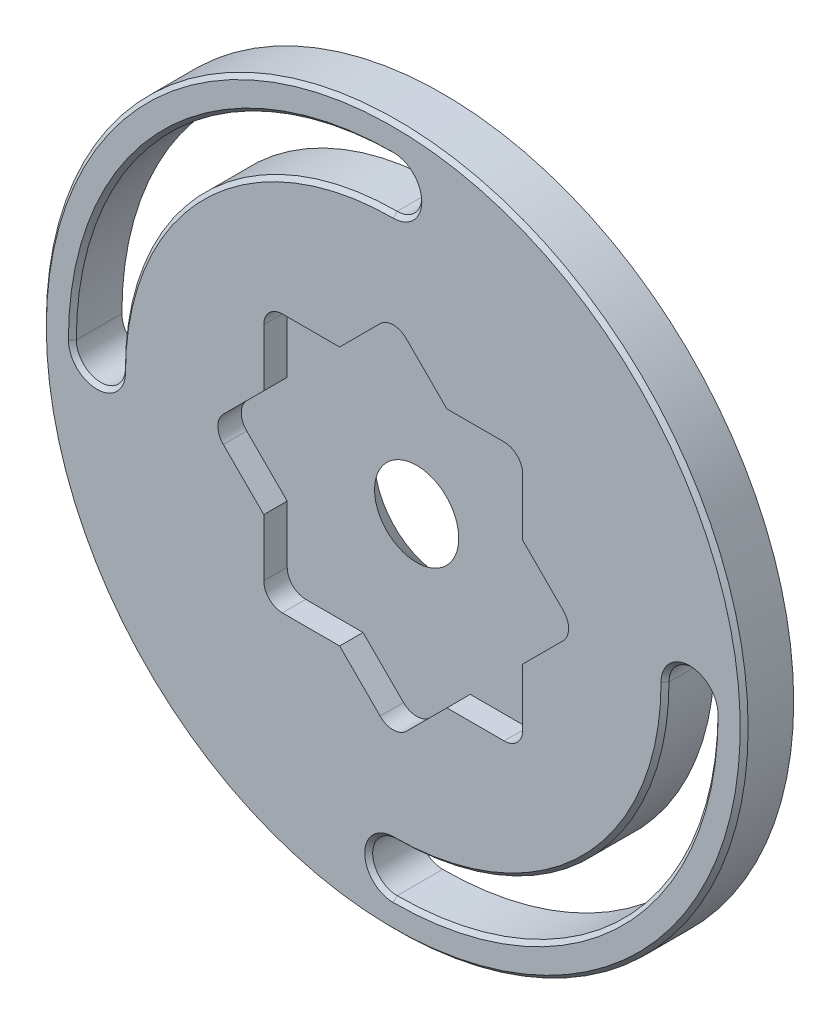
ISO-10303-21;
HEADER;
FILE_DESCRIPTION(('STEP AP214'),'2;1');
FILE_NAME('part.step','',(''),(''),'','','');
FILE_SCHEMA(('AUTOMOTIVE_DESIGN { 1 0 10303 214 1 1 1 1 }'));
ENDSEC;
DATA;
#1=APPLICATION_CONTEXT('core data for automotive mechanical design processes');
#2=APPLICATION_PROTOCOL_DEFINITION('international standard','automotive_design',2000,#1);
#3=PRODUCT_CONTEXT('',#1,'mechanical');
#4=PRODUCT('Part','Part','',(#3));
#5=PRODUCT_RELATED_PRODUCT_CATEGORY('part','',(#4));
#6=PRODUCT_DEFINITION_FORMATION('','',#4);
#7=PRODUCT_DEFINITION_CONTEXT('part definition',#1,'design');
#8=PRODUCT_DEFINITION('design','',#6,#7);
#9=PRODUCT_DEFINITION_SHAPE('','',#8);
#10=(LENGTH_UNIT() NAMED_UNIT(*) SI_UNIT(.MILLI.,.METRE.));
#11=(NAMED_UNIT(*) PLANE_ANGLE_UNIT() SI_UNIT($,.RADIAN.));
#12=(NAMED_UNIT(*) SI_UNIT($,.STERADIAN.) SOLID_ANGLE_UNIT());
#13=UNCERTAINTY_MEASURE_WITH_UNIT(LENGTH_MEASURE(1.E-05),#10,'distance_accuracy_value','');
#14=(GEOMETRIC_REPRESENTATION_CONTEXT(3) GLOBAL_UNCERTAINTY_ASSIGNED_CONTEXT((#13)) GLOBAL_UNIT_ASSIGNED_CONTEXT((#10,
#11,#12)) REPRESENTATION_CONTEXT('',''));
#15=CARTESIAN_POINT('',(0.,0.,0.));
#16=DIRECTION('',(0.,0.,1.));
#17=DIRECTION('',(1.,0.,0.));
#18=AXIS2_PLACEMENT_3D('',#15,#16,#17);
#19=CARTESIAN_POINT('',(0.,-20.1083490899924,6.35));
#20=DIRECTION('',(0.,0.,-1.));
#21=DIRECTION('',(-1.,0.,0.));
#22=AXIS2_PLACEMENT_3D('',#19,#20,#21);
#23=CYLINDRICAL_SURFACE('',#22,2.38125);
#24=DIRECTION('',(0.,0.,1.));
#25=VECTOR('',#24,1.);
#26=CARTESIAN_POINT('',(-1.68379802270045,-21.7921471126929,6.35));
#27=LINE('',#26,#25);
#28=CARTESIAN_POINT('',(-1.68379802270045,-21.7921471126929,3.35));
#29=VERTEX_POINT('',#28);
#30=CARTESIAN_POINT('',(-1.68379802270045,-21.7921471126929,6.35));
#31=VERTEX_POINT('',#30);
#32=EDGE_CURVE('E226',#29,#31,#27,.T.);
#33=ORIENTED_EDGE('',*,*,#32,.T.);
#34=CARTESIAN_POINT('',(0.,-20.1083490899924,6.35));
#35=DIRECTION('',(0.,0.,-1.));
#36=DIRECTION('',(-1.,0.,0.));
#37=AXIS2_PLACEMENT_3D('',#34,#35,#36);
#38=CIRCLE('',#37,2.38125);
#39=CARTESIAN_POINT('',(1.68379802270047,-21.7921471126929,6.35));
#40=VERTEX_POINT('',#39);
#41=EDGE_CURVE('E220',#31,#40,#38,.F.);
#42=ORIENTED_EDGE('',*,*,#41,.T.);
#43=DIRECTION('',(0.,0.,1.));
#44=VECTOR('',#43,1.);
#45=CARTESIAN_POINT('',(1.68379802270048,-21.7921471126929,6.35));
#46=LINE('',#45,#44);
#47=CARTESIAN_POINT('',(1.68379802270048,-21.7921471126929,3.35));
#48=VERTEX_POINT('',#47);
#49=EDGE_CURVE('E211',#40,#48,#46,.F.);
#50=ORIENTED_EDGE('',*,*,#49,.T.);
#51=CARTESIAN_POINT('',(0.,-20.1083490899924,3.35));
#52=DIRECTION('',(0.,0.,-1.));
#53=DIRECTION('',(-1.,0.,0.));
#54=AXIS2_PLACEMENT_3D('',#51,#52,#53);
#55=CIRCLE('',#54,2.38125);
#56=EDGE_CURVE('E377',#29,#48,#55,.F.);
#57=ORIENTED_EDGE('',*,*,#56,.F.);
#58=EDGE_LOOP('',(#33,#42,#50,#57));
#59=FACE_BOUND('',#58,.T.);
#60=ADVANCED_FACE('F15',(#59),#23,.F.);
#61=CARTESIAN_POINT('',(0.,-23.4759451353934,6.35));
#62=DIRECTION('',(0.707106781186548,-0.707106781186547,0.));
#63=DIRECTION('',(0.707106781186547,0.707106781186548,0.));
#64=AXIS2_PLACEMENT_3D('',#61,#62,#63);
#65=PLANE('',#64);
#66=DIRECTION('',(0.707106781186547,0.707106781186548,0.));
#67=VECTOR('',#66,1.);
#68=CARTESIAN_POINT('',(1.68379802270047,-21.7921471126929,6.35));
#69=LINE('',#68,#67);
#70=CARTESIAN_POINT('',(6.87594513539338,-16.6,6.35));
#71=VERTEX_POINT('',#70);
#72=EDGE_CURVE('E215',#40,#71,#69,.T.);
#73=ORIENTED_EDGE('',*,*,#72,.T.);
#74=DIRECTION('',(0.,0.,-1.));
#75=VECTOR('',#74,1.);
#76=CARTESIAN_POINT('',(6.87594513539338,-16.6,6.35));
#77=LINE('',#76,#75);
#78=CARTESIAN_POINT('',(6.87594513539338,-16.6,3.35));
#79=VERTEX_POINT('',#78);
#80=EDGE_CURVE('E202',#71,#79,#77,.T.);
#81=ORIENTED_EDGE('',*,*,#80,.T.);
#82=DIRECTION('',(0.707106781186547,0.707106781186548,0.));
#83=VECTOR('',#82,1.);
#84=CARTESIAN_POINT('',(1.68379802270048,-21.7921471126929,3.35));
#85=LINE('',#84,#83);
#86=EDGE_CURVE('E380',#48,#79,#85,.T.);
#87=ORIENTED_EDGE('',*,*,#86,.F.);
#88=ORIENTED_EDGE('',*,*,#49,.F.);
#89=EDGE_LOOP('',(#73,#81,#87,#88));
#90=FACE_BOUND('',#89,.T.);
#91=ADVANCED_FACE('F216',(#90),#65,.F.);
#92=CARTESIAN_POINT('',(-16.6,-16.6,6.35));
#93=DIRECTION('',(0.,-1.,0.));
#94=DIRECTION('',(0.,0.,-1.));
#95=AXIS2_PLACEMENT_3D('',#92,#93,#94);
#96=PLANE('',#95);
#97=DIRECTION('',(-1.,0.,0.));
#98=VECTOR('',#97,1.);
#99=CARTESIAN_POINT('',(0.,-16.6,6.35));
#100=LINE('',#99,#98);
#101=CARTESIAN_POINT('',(14.21875,-16.6,6.35));
#102=VERTEX_POINT('',#101);
#103=EDGE_CURVE('E197',#71,#102,#100,.F.);
#104=ORIENTED_EDGE('',*,*,#103,.T.);
#105=DIRECTION('',(0.,0.,-1.));
#106=VECTOR('',#105,1.);
#107=CARTESIAN_POINT('',(14.21875,-16.6,6.35));
#108=LINE('',#107,#106);
#109=CARTESIAN_POINT('',(14.21875,-16.6,3.35));
#110=VERTEX_POINT('',#109);
#111=EDGE_CURVE('E210',#102,#110,#108,.T.);
#112=ORIENTED_EDGE('',*,*,#111,.T.);
#113=DIRECTION('',(1.,0.,0.));
#114=VECTOR('',#113,1.);
#115=CARTESIAN_POINT('',(0.,-16.6,3.35));
#116=LINE('',#115,#114);
#117=EDGE_CURVE('E206',#79,#110,#116,.T.);
#118=ORIENTED_EDGE('',*,*,#117,.F.);
#119=ORIENTED_EDGE('',*,*,#80,.F.);
#120=EDGE_LOOP('',(#104,#112,#118,#119));
#121=FACE_BOUND('',#120,.T.);
#122=ADVANCED_FACE('F204',(#121),#96,.F.);
#123=CARTESIAN_POINT('',(14.21875,-14.21875,6.35));
#124=DIRECTION('',(0.,0.,-1.));
#125=DIRECTION('',(-1.,0.,0.));
#126=AXIS2_PLACEMENT_3D('',#123,#124,#125);
#127=CYLINDRICAL_SURFACE('',#126,2.38125);
#128=ORIENTED_EDGE('',*,*,#111,.F.);
#129=CARTESIAN_POINT('',(14.21875,-14.21875,6.35));
#130=DIRECTION('',(0.,0.,-1.));
#131=DIRECTION('',(-1.,0.,0.));
#132=AXIS2_PLACEMENT_3D('',#129,#130,#131);
#133=CIRCLE('',#132,2.38125);
#134=CARTESIAN_POINT('',(16.6,-14.21875,6.35));
#135=VERTEX_POINT('',#134);
#136=EDGE_CURVE('E18',#102,#135,#133,.F.);
#137=ORIENTED_EDGE('',*,*,#136,.T.);
#138=DIRECTION('',(0.,0.,-1.));
#139=VECTOR('',#138,1.);
#140=CARTESIAN_POINT('',(16.6,-14.21875,6.35));
#141=LINE('',#140,#139);
#142=CARTESIAN_POINT('',(16.6,-14.21875,3.35));
#143=VERTEX_POINT('',#142);
#144=EDGE_CURVE('E280',#135,#143,#141,.T.);
#145=ORIENTED_EDGE('',*,*,#144,.T.);
#146=CARTESIAN_POINT('',(14.21875,-14.21875,3.35));
#147=DIRECTION('',(0.,0.,-1.));
#148=DIRECTION('',(-1.,0.,0.));
#149=AXIS2_PLACEMENT_3D('',#146,#147,#148);
#150=CIRCLE('',#149,2.38125);
#151=EDGE_CURVE('E373',#110,#143,#150,.F.);
#152=ORIENTED_EDGE('',*,*,#151,.F.);
#153=EDGE_LOOP('',(#128,#137,#145,#152));
#154=FACE_BOUND('',#153,.T.);
#155=ADVANCED_FACE('F1007',(#154),#127,.F.);
#156=CARTESIAN_POINT('',(16.6,-16.6,6.35));
#157=DIRECTION('',(1.,0.,0.));
#158=DIRECTION('',(0.,0.,-1.));
#159=AXIS2_PLACEMENT_3D('',#156,#157,#158);
#160=PLANE('',#159);
#161=DIRECTION('',(0.,1.,0.));
#162=VECTOR('',#161,1.);
#163=CARTESIAN_POINT('',(16.6,0.,3.35));
#164=LINE('',#163,#162);
#165=CARTESIAN_POINT('',(16.6,-6.87594513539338,3.35));
#166=VERTEX_POINT('',#165);
#167=EDGE_CURVE('E376',#143,#166,#164,.T.);
#168=ORIENTED_EDGE('',*,*,#167,.F.);
#169=ORIENTED_EDGE('',*,*,#144,.F.);
#170=DIRECTION('',(0.,1.,0.));
#171=VECTOR('',#170,1.);
#172=CARTESIAN_POINT('',(16.6,0.,6.35));
#173=LINE('',#172,#171);
#174=CARTESIAN_POINT('',(16.6,-6.87594513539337,6.35));
#175=VERTEX_POINT('',#174);
#176=EDGE_CURVE('E228',#135,#175,#173,.T.);
#177=ORIENTED_EDGE('',*,*,#176,.T.);
#178=DIRECTION('',(0.,0.,1.));
#179=VECTOR('',#178,1.);
#180=CARTESIAN_POINT('',(16.6,-6.87594513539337,6.35));
#181=LINE('',#180,#179);
#182=EDGE_CURVE('E277',#175,#166,#181,.F.);
#183=ORIENTED_EDGE('',*,*,#182,.T.);
#184=EDGE_LOOP('',(#168,#169,#177,#183));
#185=FACE_BOUND('',#184,.T.);
#186=ADVANCED_FACE('F578',(#185),#160,.F.);
#187=CARTESIAN_POINT('',(0.,-23.4759451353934,6.35));
#188=DIRECTION('',(0.707106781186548,-0.707106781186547,0.));
#189=DIRECTION('',(0.707106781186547,0.707106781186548,0.));
#190=AXIS2_PLACEMENT_3D('',#187,#188,#189);
#191=PLANE('',#190);
#192=DIRECTION('',(0.707106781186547,0.707106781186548,0.));
#193=VECTOR('',#192,1.);
#194=CARTESIAN_POINT('',(16.6,-6.87594513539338,3.35));
#195=LINE('',#194,#193);
#196=CARTESIAN_POINT('',(21.7921471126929,-1.68379802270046,3.35));
#197=VERTEX_POINT('',#196);
#198=EDGE_CURVE('E372',#166,#197,#195,.T.);
#199=ORIENTED_EDGE('',*,*,#198,.F.);
#200=ORIENTED_EDGE('',*,*,#182,.F.);
#201=DIRECTION('',(0.707106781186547,0.707106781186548,0.));
#202=VECTOR('',#201,1.);
#203=CARTESIAN_POINT('',(16.6,-6.87594513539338,6.35));
#204=LINE('',#203,#202);
#205=CARTESIAN_POINT('',(21.7921471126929,-1.68379802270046,6.35));
#206=VERTEX_POINT('',#205);
#207=EDGE_CURVE('E407',#175,#206,#204,.T.);
#208=ORIENTED_EDGE('',*,*,#207,.T.);
#209=DIRECTION('',(0.,0.,-1.));
#210=VECTOR('',#209,1.);
#211=CARTESIAN_POINT('',(21.7921471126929,-1.68379802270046,6.35));
#212=LINE('',#211,#210);
#213=EDGE_CURVE('E275',#206,#197,#212,.T.);
#214=ORIENTED_EDGE('',*,*,#213,.T.);
#215=EDGE_LOOP('',(#199,#200,#208,#214));
#216=FACE_BOUND('',#215,.T.);
#217=ADVANCED_FACE('F580',(#216),#191,.F.);
#218=CARTESIAN_POINT('',(20.1083490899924,0.,6.35));
#219=DIRECTION('',(0.,0.,-1.));
#220=DIRECTION('',(-1.,0.,0.));
#221=AXIS2_PLACEMENT_3D('',#218,#219,#220);
#222=CYLINDRICAL_SURFACE('',#221,2.38125);
#223=ORIENTED_EDGE('',*,*,#213,.F.);
#224=CARTESIAN_POINT('',(20.1083490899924,0.,6.35));
#225=DIRECTION('',(0.,0.,-1.));
#226=DIRECTION('',(-1.,0.,0.));
#227=AXIS2_PLACEMENT_3D('',#224,#225,#226);
#228=CIRCLE('',#227,2.38125);
#229=CARTESIAN_POINT('',(21.7921471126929,1.68379802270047,6.35));
#230=VERTEX_POINT('',#229);
#231=EDGE_CURVE('E405',#206,#230,#228,.F.);
#232=ORIENTED_EDGE('',*,*,#231,.T.);
#233=DIRECTION('',(0.,0.,1.));
#234=VECTOR('',#233,1.);
#235=CARTESIAN_POINT('',(21.7921471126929,1.68379802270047,6.35));
#236=LINE('',#235,#234);
#237=CARTESIAN_POINT('',(21.7921471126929,1.68379802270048,3.35));
#238=VERTEX_POINT('',#237);
#239=EDGE_CURVE('E273',#230,#238,#236,.F.);
#240=ORIENTED_EDGE('',*,*,#239,.T.);
#241=CARTESIAN_POINT('',(20.1083490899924,0.,3.35));
#242=DIRECTION('',(0.,0.,-1.));
#243=DIRECTION('',(-1.,0.,0.));
#244=AXIS2_PLACEMENT_3D('',#241,#242,#243);
#245=CIRCLE('',#244,2.38125);
#246=EDGE_CURVE('E368',#197,#238,#245,.F.);
#247=ORIENTED_EDGE('',*,*,#246,.F.);
#248=EDGE_LOOP('',(#223,#232,#240,#247));
#249=FACE_BOUND('',#248,.T.);
#250=ADVANCED_FACE('F596',(#249),#222,.F.);
#251=CARTESIAN_POINT('',(23.4759451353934,0.,6.35));
#252=DIRECTION('',(0.707106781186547,0.707106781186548,0.));
#253=DIRECTION('',(-0.707106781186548,0.707106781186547,0.));
#254=AXIS2_PLACEMENT_3D('',#251,#252,#253);
#255=PLANE('',#254);
#256=DIRECTION('',(-0.707106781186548,0.707106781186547,0.));
#257=VECTOR('',#256,1.);
#258=CARTESIAN_POINT('',(21.7921471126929,1.68379802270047,6.35));
#259=LINE('',#258,#257);
#260=CARTESIAN_POINT('',(16.6,6.87594513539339,6.35));
#261=VERTEX_POINT('',#260);
#262=EDGE_CURVE('E406',#230,#261,#259,.T.);
#263=ORIENTED_EDGE('',*,*,#262,.T.);
#264=DIRECTION('',(0.,0.,-1.));
#265=VECTOR('',#264,1.);
#266=CARTESIAN_POINT('',(16.6,6.87594513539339,6.35));
#267=LINE('',#266,#265);
#268=CARTESIAN_POINT('',(16.6,6.87594513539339,3.35));
#269=VERTEX_POINT('',#268);
#270=EDGE_CURVE('E270',#261,#269,#267,.T.);
#271=ORIENTED_EDGE('',*,*,#270,.T.);
#272=DIRECTION('',(-0.707106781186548,0.707106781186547,0.));
#273=VECTOR('',#272,1.);
#274=CARTESIAN_POINT('',(21.7921471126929,1.68379802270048,3.35));
#275=LINE('',#274,#273);
#276=EDGE_CURVE('E371',#238,#269,#275,.T.);
#277=ORIENTED_EDGE('',*,*,#276,.F.);
#278=ORIENTED_EDGE('',*,*,#239,.F.);
#279=EDGE_LOOP('',(#263,#271,#277,#278));
#280=FACE_BOUND('',#279,.T.);
#281=ADVANCED_FACE('F586',(#280),#255,.F.);
#282=CARTESIAN_POINT('',(16.6,-16.6,6.35));
#283=DIRECTION('',(1.,0.,0.));
#284=DIRECTION('',(0.,0.,-1.));
#285=AXIS2_PLACEMENT_3D('',#282,#283,#284);
#286=PLANE('',#285);
#287=DIRECTION('',(0.,1.,0.));
#288=VECTOR('',#287,1.);
#289=CARTESIAN_POINT('',(16.6,0.,6.35));
#290=LINE('',#289,#288);
#291=CARTESIAN_POINT('',(16.6,14.21875,6.35));
#292=VERTEX_POINT('',#291);
#293=EDGE_CURVE('E404',#261,#292,#290,.T.);
#294=ORIENTED_EDGE('',*,*,#293,.T.);
#295=DIRECTION('',(0.,0.,-1.));
#296=VECTOR('',#295,1.);
#297=CARTESIAN_POINT('',(16.6,14.21875,6.35));
#298=LINE('',#297,#296);
#299=CARTESIAN_POINT('',(16.6,14.21875,3.35));
#300=VERTEX_POINT('',#299);
#301=EDGE_CURVE('E267',#292,#300,#298,.T.);
#302=ORIENTED_EDGE('',*,*,#301,.T.);
#303=DIRECTION('',(0.,1.,0.));
#304=VECTOR('',#303,1.);
#305=CARTESIAN_POINT('',(16.6,0.,3.35));
#306=LINE('',#305,#304);
#307=EDGE_CURVE('E367',#269,#300,#306,.T.);
#308=ORIENTED_EDGE('',*,*,#307,.F.);
#309=ORIENTED_EDGE('',*,*,#270,.F.);
#310=EDGE_LOOP('',(#294,#302,#308,#309));
#311=FACE_BOUND('',#310,.T.);
#312=ADVANCED_FACE('F590',(#311),#286,.F.);
#313=CARTESIAN_POINT('',(14.21875,14.21875,6.35));
#314=DIRECTION('',(0.,0.,-1.));
#315=DIRECTION('',(-1.,0.,0.));
#316=AXIS2_PLACEMENT_3D('',#313,#314,#315);
#317=CYLINDRICAL_SURFACE('',#316,2.38125);
#318=ORIENTED_EDGE('',*,*,#301,.F.);
#319=CARTESIAN_POINT('',(14.21875,14.21875,6.35));
#320=DIRECTION('',(0.,0.,-1.));
#321=DIRECTION('',(-1.,0.,0.));
#322=AXIS2_PLACEMENT_3D('',#319,#320,#321);
#323=CIRCLE('',#322,2.38125);
#324=CARTESIAN_POINT('',(14.21875,16.6,6.35));
#325=VERTEX_POINT('',#324);
#326=EDGE_CURVE('E401',#292,#325,#323,.F.);
#327=ORIENTED_EDGE('',*,*,#326,.T.);
#328=DIRECTION('',(0.,0.,1.));
#329=VECTOR('',#328,1.);
#330=CARTESIAN_POINT('',(14.21875,16.6,6.35));
#331=LINE('',#330,#329);
#332=CARTESIAN_POINT('',(14.21875,16.6,3.35));
#333=VERTEX_POINT('',#332);
#334=EDGE_CURVE('E264',#325,#333,#331,.F.);
#335=ORIENTED_EDGE('',*,*,#334,.T.);
#336=CARTESIAN_POINT('',(14.21875,14.21875,3.35));
#337=DIRECTION('',(0.,0.,-1.));
#338=DIRECTION('',(-1.,0.,0.));
#339=AXIS2_PLACEMENT_3D('',#336,#337,#338);
#340=CIRCLE('',#339,2.38125);
#341=EDGE_CURVE('E362',#300,#333,#340,.F.);
#342=ORIENTED_EDGE('',*,*,#341,.F.);
#343=EDGE_LOOP('',(#318,#327,#335,#342));
#344=FACE_BOUND('',#343,.T.);
#345=ADVANCED_FACE('F742',(#344),#317,.F.);
#346=CARTESIAN_POINT('',(16.6,16.6,6.35));
#347=DIRECTION('',(0.,1.,0.));
#348=DIRECTION('',(0.,0.,1.));
#349=AXIS2_PLACEMENT_3D('',#346,#347,#348);
#350=PLANE('',#349);
#351=DIRECTION('',(1.,0.,0.));
#352=VECTOR('',#351,1.);
#353=CARTESIAN_POINT('',(0.,16.6,3.35));
#354=LINE('',#353,#352);
#355=CARTESIAN_POINT('',(6.87594513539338,16.6,3.35));
#356=VERTEX_POINT('',#355);
#357=EDGE_CURVE('E366',#333,#356,#354,.F.);
#358=ORIENTED_EDGE('',*,*,#357,.F.);
#359=ORIENTED_EDGE('',*,*,#334,.F.);
#360=DIRECTION('',(-1.,0.,0.));
#361=VECTOR('',#360,1.);
#362=CARTESIAN_POINT('',(0.,16.6,6.35));
#363=LINE('',#362,#361);
#364=CARTESIAN_POINT('',(6.87594513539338,16.6,6.35));
#365=VERTEX_POINT('',#364);
#366=EDGE_CURVE('E403',#325,#365,#363,.T.);
#367=ORIENTED_EDGE('',*,*,#366,.T.);
#368=DIRECTION('',(0.,0.,1.));
#369=VECTOR('',#368,1.);
#370=CARTESIAN_POINT('',(6.87594513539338,16.6,6.35));
#371=LINE('',#370,#369);
#372=EDGE_CURVE('E261',#365,#356,#371,.F.);
#373=ORIENTED_EDGE('',*,*,#372,.T.);
#374=EDGE_LOOP('',(#358,#359,#367,#373));
#375=FACE_BOUND('',#374,.T.);
#376=ADVANCED_FACE('F738',(#375),#350,.F.);
#377=CARTESIAN_POINT('',(23.4759451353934,0.,6.35));
#378=DIRECTION('',(0.707106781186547,0.707106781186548,0.));
#379=DIRECTION('',(-0.707106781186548,0.707106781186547,0.));
#380=AXIS2_PLACEMENT_3D('',#377,#378,#379);
#381=PLANE('',#380);
#382=DIRECTION('',(-0.707106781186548,0.707106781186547,0.));
#383=VECTOR('',#382,1.);
#384=CARTESIAN_POINT('',(6.87594513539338,16.6,3.35));
#385=LINE('',#384,#383);
#386=CARTESIAN_POINT('',(1.68379802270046,21.7921471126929,3.35));
#387=VERTEX_POINT('',#386);
#388=EDGE_CURVE('E361',#356,#387,#385,.T.);
#389=ORIENTED_EDGE('',*,*,#388,.F.);
#390=ORIENTED_EDGE('',*,*,#372,.F.);
#391=DIRECTION('',(-0.707106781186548,0.707106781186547,0.));
#392=VECTOR('',#391,1.);
#393=CARTESIAN_POINT('',(6.87594513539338,16.6,6.35));
#394=LINE('',#393,#392);
#395=CARTESIAN_POINT('',(1.68379802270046,21.7921471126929,6.35));
#396=VERTEX_POINT('',#395);
#397=EDGE_CURVE('E400',#365,#396,#394,.T.);
#398=ORIENTED_EDGE('',*,*,#397,.T.);
#399=DIRECTION('',(0.,0.,-1.));
#400=VECTOR('',#399,1.);
#401=CARTESIAN_POINT('',(1.68379802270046,21.7921471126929,6.35));
#402=LINE('',#401,#400);
#403=EDGE_CURVE('E259',#396,#387,#402,.T.);
#404=ORIENTED_EDGE('',*,*,#403,.T.);
#405=EDGE_LOOP('',(#389,#390,#398,#404));
#406=FACE_BOUND('',#405,.T.);
#407=ADVANCED_FACE('F734',(#406),#381,.F.);
#408=CARTESIAN_POINT('',(0.,20.1083490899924,6.35));
#409=DIRECTION('',(0.,0.,-1.));
#410=DIRECTION('',(-1.,0.,0.));
#411=AXIS2_PLACEMENT_3D('',#408,#409,#410);
#412=CYLINDRICAL_SURFACE('',#411,2.38125);
#413=ORIENTED_EDGE('',*,*,#403,.F.);
#414=CARTESIAN_POINT('',(0.,20.1083490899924,6.35));
#415=DIRECTION('',(0.,0.,-1.));
#416=DIRECTION('',(-1.,0.,0.));
#417=AXIS2_PLACEMENT_3D('',#414,#415,#416);
#418=CIRCLE('',#417,2.38125);
#419=CARTESIAN_POINT('',(-1.68379802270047,21.7921471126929,6.35));
#420=VERTEX_POINT('',#419);
#421=EDGE_CURVE('E397',#396,#420,#418,.F.);
#422=ORIENTED_EDGE('',*,*,#421,.T.);
#423=DIRECTION('',(0.,0.,1.));
#424=VECTOR('',#423,1.);
#425=CARTESIAN_POINT('',(-1.68379802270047,21.7921471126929,6.35));
#426=LINE('',#425,#424);
#427=CARTESIAN_POINT('',(-1.68379802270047,21.7921471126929,3.35));
#428=VERTEX_POINT('',#427);
#429=EDGE_CURVE('E257',#420,#428,#426,.F.);
#430=ORIENTED_EDGE('',*,*,#429,.T.);
#431=CARTESIAN_POINT('',(0.,20.1083490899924,3.35));
#432=DIRECTION('',(0.,0.,-1.));
#433=DIRECTION('',(-1.,0.,0.));
#434=AXIS2_PLACEMENT_3D('',#431,#432,#433);
#435=CIRCLE('',#434,2.38125);
#436=EDGE_CURVE('E357',#387,#428,#435,.F.);
#437=ORIENTED_EDGE('',*,*,#436,.F.);
#438=EDGE_LOOP('',(#413,#422,#430,#437));
#439=FACE_BOUND('',#438,.T.);
#440=ADVANCED_FACE('F730',(#439),#412,.F.);
#441=CARTESIAN_POINT('',(0.,23.4759451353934,6.35));
#442=DIRECTION('',(-0.707106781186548,0.707106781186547,0.));
#443=DIRECTION('',(-0.707106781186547,-0.707106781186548,0.));
#444=AXIS2_PLACEMENT_3D('',#441,#442,#443);
#445=PLANE('',#444);
#446=DIRECTION('',(-0.707106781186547,-0.707106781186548,0.));
#447=VECTOR('',#446,1.);
#448=CARTESIAN_POINT('',(-1.68379802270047,21.7921471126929,6.35));
#449=LINE('',#448,#447);
#450=CARTESIAN_POINT('',(-6.87594513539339,16.6,6.35));
#451=VERTEX_POINT('',#450);
#452=EDGE_CURVE('E399',#420,#451,#449,.T.);
#453=ORIENTED_EDGE('',*,*,#452,.T.);
#454=DIRECTION('',(0.,0.,1.));
#455=VECTOR('',#454,1.);
#456=CARTESIAN_POINT('',(-6.87594513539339,16.6,6.35));
#457=LINE('',#456,#455);
#458=CARTESIAN_POINT('',(-6.87594513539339,16.6,3.35));
#459=VERTEX_POINT('',#458);
#460=EDGE_CURVE('E254',#451,#459,#457,.F.);
#461=ORIENTED_EDGE('',*,*,#460,.T.);
#462=DIRECTION('',(-0.707106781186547,-0.707106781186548,0.));
#463=VECTOR('',#462,1.);
#464=CARTESIAN_POINT('',(-1.68379802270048,21.7921471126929,3.35));
#465=LINE('',#464,#463);
#466=EDGE_CURVE('E360',#428,#459,#465,.T.);
#467=ORIENTED_EDGE('',*,*,#466,.F.);
#468=ORIENTED_EDGE('',*,*,#429,.F.);
#469=EDGE_LOOP('',(#453,#461,#467,#468));
#470=FACE_BOUND('',#469,.T.);
#471=ADVANCED_FACE('F726',(#470),#445,.F.);
#472=CARTESIAN_POINT('',(16.6,16.6,6.35));
#473=DIRECTION('',(0.,1.,0.));
#474=DIRECTION('',(0.,0.,1.));
#475=AXIS2_PLACEMENT_3D('',#472,#473,#474);
#476=PLANE('',#475);
#477=DIRECTION('',(-1.,0.,0.));
#478=VECTOR('',#477,1.);
#479=CARTESIAN_POINT('',(0.,16.6,6.35));
#480=LINE('',#479,#478);
#481=CARTESIAN_POINT('',(-14.21875,16.6,6.35));
#482=VERTEX_POINT('',#481);
#483=EDGE_CURVE('E396',#451,#482,#480,.T.);
#484=ORIENTED_EDGE('',*,*,#483,.T.);
#485=DIRECTION('',(0.,0.,-1.));
#486=VECTOR('',#485,1.);
#487=CARTESIAN_POINT('',(-14.21875,16.6,6.35));
#488=LINE('',#487,#486);
#489=CARTESIAN_POINT('',(-14.21875,16.6,3.35));
#490=VERTEX_POINT('',#489);
#491=EDGE_CURVE('E252',#482,#490,#488,.T.);
#492=ORIENTED_EDGE('',*,*,#491,.T.);
#493=DIRECTION('',(1.,0.,0.));
#494=VECTOR('',#493,1.);
#495=CARTESIAN_POINT('',(0.,16.6,3.35));
#496=LINE('',#495,#494);
#497=EDGE_CURVE('E356',#459,#490,#496,.F.);
#498=ORIENTED_EDGE('',*,*,#497,.F.);
#499=ORIENTED_EDGE('',*,*,#460,.F.);
#500=EDGE_LOOP('',(#484,#492,#498,#499));
#501=FACE_BOUND('',#500,.T.);
#502=ADVANCED_FACE('F722',(#501),#476,.F.);
#503=CARTESIAN_POINT('',(-14.21875,14.21875,6.35));
#504=DIRECTION('',(0.,0.,-1.));
#505=DIRECTION('',(-1.,0.,0.));
#506=AXIS2_PLACEMENT_3D('',#503,#504,#505);
#507=CYLINDRICAL_SURFACE('',#506,2.38125);
#508=ORIENTED_EDGE('',*,*,#491,.F.);
#509=CARTESIAN_POINT('',(-14.21875,14.21875,6.35));
#510=DIRECTION('',(0.,0.,-1.));
#511=DIRECTION('',(-1.,0.,0.));
#512=AXIS2_PLACEMENT_3D('',#509,#510,#511);
#513=CIRCLE('',#512,2.38125);
#514=CARTESIAN_POINT('',(-16.6,14.21875,6.35));
#515=VERTEX_POINT('',#514);
#516=EDGE_CURVE('E393',#482,#515,#513,.F.);
#517=ORIENTED_EDGE('',*,*,#516,.T.);
#518=DIRECTION('',(0.,0.,1.));
#519=VECTOR('',#518,1.);
#520=CARTESIAN_POINT('',(-16.6,14.21875,6.35));
#521=LINE('',#520,#519);
#522=CARTESIAN_POINT('',(-16.6,14.21875,3.35));
#523=VERTEX_POINT('',#522);
#524=EDGE_CURVE('E250',#515,#523,#521,.F.);
#525=ORIENTED_EDGE('',*,*,#524,.T.);
#526=CARTESIAN_POINT('',(-14.21875,14.21875,3.35));
#527=DIRECTION('',(0.,0.,-1.));
#528=DIRECTION('',(-1.,0.,0.));
#529=AXIS2_PLACEMENT_3D('',#526,#527,#528);
#530=CIRCLE('',#529,2.38125);
#531=EDGE_CURVE('E352',#490,#523,#530,.F.);
#532=ORIENTED_EDGE('',*,*,#531,.F.);
#533=EDGE_LOOP('',(#508,#517,#525,#532));
#534=FACE_BOUND('',#533,.T.);
#535=ADVANCED_FACE('F718',(#534),#507,.F.);
#536=CARTESIAN_POINT('',(-16.6,16.6,6.35));
#537=DIRECTION('',(-1.,0.,0.));
#538=DIRECTION('',(0.,0.,1.));
#539=AXIS2_PLACEMENT_3D('',#536,#537,#538);
#540=PLANE('',#539);
#541=DIRECTION('',(0.,1.,0.));
#542=VECTOR('',#541,1.);
#543=CARTESIAN_POINT('',(-16.6,0.,3.35));
#544=LINE('',#543,#542);
#545=CARTESIAN_POINT('',(-16.6,6.87594513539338,3.35));
#546=VERTEX_POINT('',#545);
#547=EDGE_CURVE('E355',#523,#546,#544,.F.);
#548=ORIENTED_EDGE('',*,*,#547,.F.);
#549=ORIENTED_EDGE('',*,*,#524,.F.);
#550=DIRECTION('',(0.,1.,0.));
#551=VECTOR('',#550,1.);
#552=CARTESIAN_POINT('',(-16.6,0.,6.35));
#553=LINE('',#552,#551);
#554=CARTESIAN_POINT('',(-16.6,6.87594513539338,6.35));
#555=VERTEX_POINT('',#554);
#556=EDGE_CURVE('E395',#515,#555,#553,.F.);
#557=ORIENTED_EDGE('',*,*,#556,.T.);
#558=DIRECTION('',(0.,0.,1.));
#559=VECTOR('',#558,1.);
#560=CARTESIAN_POINT('',(-16.6,6.87594513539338,6.35));
#561=LINE('',#560,#559);
#562=EDGE_CURVE('E247',#555,#546,#561,.F.);
#563=ORIENTED_EDGE('',*,*,#562,.T.);
#564=EDGE_LOOP('',(#548,#549,#557,#563));
#565=FACE_BOUND('',#564,.T.);
#566=ADVANCED_FACE('F714',(#565),#540,.F.);
#567=CARTESIAN_POINT('',(0.,23.4759451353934,6.35));
#568=DIRECTION('',(-0.707106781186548,0.707106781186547,0.));
#569=DIRECTION('',(-0.707106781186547,-0.707106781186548,0.));
#570=AXIS2_PLACEMENT_3D('',#567,#568,#569);
#571=PLANE('',#570);
#572=DIRECTION('',(-0.707106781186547,-0.707106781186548,0.));
#573=VECTOR('',#572,1.);
#574=CARTESIAN_POINT('',(-16.6,6.87594513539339,3.35));
#575=LINE('',#574,#573);
#576=CARTESIAN_POINT('',(-21.7921471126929,1.68379802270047,3.35));
#577=VERTEX_POINT('',#576);
#578=EDGE_CURVE('E351',#546,#577,#575,.T.);
#579=ORIENTED_EDGE('',*,*,#578,.F.);
#580=ORIENTED_EDGE('',*,*,#562,.F.);
#581=DIRECTION('',(-0.707106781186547,-0.707106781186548,0.));
#582=VECTOR('',#581,1.);
#583=CARTESIAN_POINT('',(-16.6,6.87594513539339,6.35));
#584=LINE('',#583,#582);
#585=CARTESIAN_POINT('',(-21.7921471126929,1.68379802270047,6.35));
#586=VERTEX_POINT('',#585);
#587=EDGE_CURVE('E392',#555,#586,#584,.T.);
#588=ORIENTED_EDGE('',*,*,#587,.T.);
#589=DIRECTION('',(0.,0.,-1.));
#590=VECTOR('',#589,1.);
#591=CARTESIAN_POINT('',(-21.7921471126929,1.68379802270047,6.35));
#592=LINE('',#591,#590);
#593=EDGE_CURVE('E245',#586,#577,#592,.T.);
#594=ORIENTED_EDGE('',*,*,#593,.T.);
#595=EDGE_LOOP('',(#579,#580,#588,#594));
#596=FACE_BOUND('',#595,.T.);
#597=ADVANCED_FACE('F710',(#596),#571,.F.);
#598=CARTESIAN_POINT('',(-20.1083490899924,0.,6.35));
#599=DIRECTION('',(0.,0.,-1.));
#600=DIRECTION('',(-1.,0.,0.));
#601=AXIS2_PLACEMENT_3D('',#598,#599,#600);
#602=CYLINDRICAL_SURFACE('',#601,2.38125);
#603=ORIENTED_EDGE('',*,*,#593,.F.);
#604=CARTESIAN_POINT('',(-20.1083490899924,0.,6.35));
#605=DIRECTION('',(0.,0.,-1.));
#606=DIRECTION('',(-1.,0.,0.));
#607=AXIS2_PLACEMENT_3D('',#604,#605,#606);
#608=CIRCLE('',#607,2.38125);
#609=CARTESIAN_POINT('',(-21.7921471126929,-1.68379802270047,6.35));
#610=VERTEX_POINT('',#609);
#611=EDGE_CURVE('E389',#586,#610,#608,.F.);
#612=ORIENTED_EDGE('',*,*,#611,.T.);
#613=DIRECTION('',(0.,0.,1.));
#614=VECTOR('',#613,1.);
#615=CARTESIAN_POINT('',(-21.7921471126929,-1.68379802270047,6.35));
#616=LINE('',#615,#614);
#617=CARTESIAN_POINT('',(-21.7921471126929,-1.68379802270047,3.35));
#618=VERTEX_POINT('',#617);
#619=EDGE_CURVE('E243',#610,#618,#616,.F.);
#620=ORIENTED_EDGE('',*,*,#619,.T.);
#621=CARTESIAN_POINT('',(-20.1083490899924,0.,3.35));
#622=DIRECTION('',(0.,0.,-1.));
#623=DIRECTION('',(-1.,0.,0.));
#624=AXIS2_PLACEMENT_3D('',#621,#622,#623);
#625=CIRCLE('',#624,2.38125);
#626=EDGE_CURVE('E347',#577,#618,#625,.F.);
#627=ORIENTED_EDGE('',*,*,#626,.F.);
#628=EDGE_LOOP('',(#603,#612,#620,#627));
#629=FACE_BOUND('',#628,.T.);
#630=ADVANCED_FACE('F706',(#629),#602,.F.);
#631=CARTESIAN_POINT('',(-23.4759451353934,0.,6.35));
#632=DIRECTION('',(-0.707106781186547,-0.707106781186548,0.));
#633=DIRECTION('',(0.707106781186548,-0.707106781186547,0.));
#634=AXIS2_PLACEMENT_3D('',#631,#632,#633);
#635=PLANE('',#634);
#636=DIRECTION('',(0.707106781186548,-0.707106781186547,0.));
#637=VECTOR('',#636,1.);
#638=CARTESIAN_POINT('',(-21.7921471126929,-1.68379802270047,6.35));
#639=LINE('',#638,#637);
#640=CARTESIAN_POINT('',(-16.6,-6.87594513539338,6.35));
#641=VERTEX_POINT('',#640);
#642=EDGE_CURVE('E391',#610,#641,#639,.T.);
#643=ORIENTED_EDGE('',*,*,#642,.T.);
#644=DIRECTION('',(0.,0.,1.));
#645=VECTOR('',#644,1.);
#646=CARTESIAN_POINT('',(-16.6,-6.87594513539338,6.35));
#647=LINE('',#646,#645);
#648=CARTESIAN_POINT('',(-16.6,-6.87594513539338,3.35));
#649=VERTEX_POINT('',#648);
#650=EDGE_CURVE('E240',#641,#649,#647,.F.);
#651=ORIENTED_EDGE('',*,*,#650,.T.);
#652=DIRECTION('',(0.707106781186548,-0.707106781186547,0.));
#653=VECTOR('',#652,1.);
#654=CARTESIAN_POINT('',(-21.7921471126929,-1.68379802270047,3.35));
#655=LINE('',#654,#653);
#656=EDGE_CURVE('E350',#618,#649,#655,.T.);
#657=ORIENTED_EDGE('',*,*,#656,.F.);
#658=ORIENTED_EDGE('',*,*,#619,.F.);
#659=EDGE_LOOP('',(#643,#651,#657,#658));
#660=FACE_BOUND('',#659,.T.);
#661=ADVANCED_FACE('F702',(#660),#635,.F.);
#662=CARTESIAN_POINT('',(-16.6,16.6,6.35));
#663=DIRECTION('',(-1.,0.,0.));
#664=DIRECTION('',(0.,0.,1.));
#665=AXIS2_PLACEMENT_3D('',#662,#663,#664);
#666=PLANE('',#665);
#667=DIRECTION('',(0.,1.,0.));
#668=VECTOR('',#667,1.);
#669=CARTESIAN_POINT('',(-16.6,0.,6.35));
#670=LINE('',#669,#668);
#671=CARTESIAN_POINT('',(-16.6,-14.21875,6.35));
#672=VERTEX_POINT('',#671);
#673=EDGE_CURVE('E388',#641,#672,#670,.F.);
#674=ORIENTED_EDGE('',*,*,#673,.T.);
#675=DIRECTION('',(0.,0.,-1.));
#676=VECTOR('',#675,1.);
#677=CARTESIAN_POINT('',(-16.6,-14.21875,6.35));
#678=LINE('',#677,#676);
#679=CARTESIAN_POINT('',(-16.6,-14.21875,3.35));
#680=VERTEX_POINT('',#679);
#681=EDGE_CURVE('E238',#672,#680,#678,.T.);
#682=ORIENTED_EDGE('',*,*,#681,.T.);
#683=DIRECTION('',(0.,1.,0.));
#684=VECTOR('',#683,1.);
#685=CARTESIAN_POINT('',(-16.6,0.,3.35));
#686=LINE('',#685,#684);
#687=EDGE_CURVE('E346',#649,#680,#686,.F.);
#688=ORIENTED_EDGE('',*,*,#687,.F.);
#689=ORIENTED_EDGE('',*,*,#650,.F.);
#690=EDGE_LOOP('',(#674,#682,#688,#689));
#691=FACE_BOUND('',#690,.T.);
#692=ADVANCED_FACE('F698',(#691),#666,.F.);
#693=CARTESIAN_POINT('',(-14.21875,-14.21875,6.35));
#694=DIRECTION('',(0.,0.,-1.));
#695=DIRECTION('',(-1.,0.,0.));
#696=AXIS2_PLACEMENT_3D('',#693,#694,#695);
#697=CYLINDRICAL_SURFACE('',#696,2.38125);
#698=ORIENTED_EDGE('',*,*,#681,.F.);
#699=CARTESIAN_POINT('',(-14.21875,-14.21875,6.35));
#700=DIRECTION('',(0.,0.,-1.));
#701=DIRECTION('',(-1.,0.,0.));
#702=AXIS2_PLACEMENT_3D('',#699,#700,#701);
#703=CIRCLE('',#702,2.38125);
#704=CARTESIAN_POINT('',(-14.21875,-16.6,6.35));
#705=VERTEX_POINT('',#704);
#706=EDGE_CURVE('E385',#672,#705,#703,.F.);
#707=ORIENTED_EDGE('',*,*,#706,.T.);
#708=DIRECTION('',(0.,0.,-1.));
#709=VECTOR('',#708,1.);
#710=CARTESIAN_POINT('',(-14.21875,-16.6,6.35));
#711=LINE('',#710,#709);
#712=CARTESIAN_POINT('',(-14.21875,-16.6,3.35));
#713=VERTEX_POINT('',#712);
#714=EDGE_CURVE('E236',#705,#713,#711,.T.);
#715=ORIENTED_EDGE('',*,*,#714,.T.);
#716=CARTESIAN_POINT('',(-14.21875,-14.21875,3.35));
#717=DIRECTION('',(0.,0.,-1.));
#718=DIRECTION('',(-1.,0.,0.));
#719=AXIS2_PLACEMENT_3D('',#716,#717,#718);
#720=CIRCLE('',#719,2.38125);
#721=EDGE_CURVE('E342',#680,#713,#720,.F.);
#722=ORIENTED_EDGE('',*,*,#721,.F.);
#723=EDGE_LOOP('',(#698,#707,#715,#722));
#724=FACE_BOUND('',#723,.T.);
#725=ADVANCED_FACE('F694',(#724),#697,.F.);
#726=CARTESIAN_POINT('',(-16.6,-16.6,6.35));
#727=DIRECTION('',(0.,-1.,0.));
#728=DIRECTION('',(0.,0.,-1.));
#729=AXIS2_PLACEMENT_3D('',#726,#727,#728);
#730=PLANE('',#729);
#731=DIRECTION('',(1.,0.,0.));
#732=VECTOR('',#731,1.);
#733=CARTESIAN_POINT('',(0.,-16.6,3.35));
#734=LINE('',#733,#732);
#735=CARTESIAN_POINT('',(-6.87594513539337,-16.6,3.35));
#736=VERTEX_POINT('',#735);
#737=EDGE_CURVE('E345',#713,#736,#734,.T.);
#738=ORIENTED_EDGE('',*,*,#737,.F.);
#739=ORIENTED_EDGE('',*,*,#714,.F.);
#740=DIRECTION('',(-1.,0.,0.));
#741=VECTOR('',#740,1.);
#742=CARTESIAN_POINT('',(0.,-16.6,6.35));
#743=LINE('',#742,#741);
#744=CARTESIAN_POINT('',(-6.87594513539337,-16.6,6.35));
#745=VERTEX_POINT('',#744);
#746=EDGE_CURVE('E387',#705,#745,#743,.F.);
#747=ORIENTED_EDGE('',*,*,#746,.T.);
#748=DIRECTION('',(0.,0.,1.));
#749=VECTOR('',#748,1.);
#750=CARTESIAN_POINT('',(-6.87594513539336,-16.6,6.35));
#751=LINE('',#750,#749);
#752=EDGE_CURVE('E229',#745,#736,#751,.F.);
#753=ORIENTED_EDGE('',*,*,#752,.T.);
#754=EDGE_LOOP('',(#738,#739,#747,#753));
#755=FACE_BOUND('',#754,.T.);
#756=ADVANCED_FACE('F690',(#755),#730,.F.);
#757=CARTESIAN_POINT('',(-23.4759451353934,0.,6.35));
#758=DIRECTION('',(-0.707106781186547,-0.707106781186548,0.));
#759=DIRECTION('',(0.707106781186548,-0.707106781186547,0.));
#760=AXIS2_PLACEMENT_3D('',#757,#758,#759);
#761=PLANE('',#760);
#762=DIRECTION('',(0.707106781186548,-0.707106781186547,0.));
#763=VECTOR('',#762,1.);
#764=CARTESIAN_POINT('',(-6.87594513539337,-16.6,3.35));
#765=LINE('',#764,#763);
#766=EDGE_CURVE('E341',#736,#29,#765,.T.);
#767=ORIENTED_EDGE('',*,*,#766,.F.);
#768=ORIENTED_EDGE('',*,*,#752,.F.);
#769=DIRECTION('',(0.707106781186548,-0.707106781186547,0.));
#770=VECTOR('',#769,1.);
#771=CARTESIAN_POINT('',(-6.87594513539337,-16.6,6.35));
#772=LINE('',#771,#770);
#773=EDGE_CURVE('E384',#745,#31,#772,.T.);
#774=ORIENTED_EDGE('',*,*,#773,.T.);
#775=ORIENTED_EDGE('',*,*,#32,.F.);
#776=EDGE_LOOP('',(#767,#768,#774,#775));
#777=FACE_BOUND('',#776,.T.);
#778=ADVANCED_FACE('F686',(#777),#761,.F.);
#779=CARTESIAN_POINT('',(0.,0.,6.35));
#780=DIRECTION('',(0.,0.,-1.));
#781=DIRECTION('',(-1.,0.,0.));
#782=AXIS2_PLACEMENT_3D('',#779,#780,#781);
#783=PLANE('',#782);
#784=CARTESIAN_POINT('',(38.,0.,6.35000000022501));
#785=DIRECTION('',(0.,0.,1.));
#786=DIRECTION('',(0.,-1.,0.));
#787=AXIS2_PLACEMENT_3D('',#784,#785,#786);
#788=CIRCLE('',#787,3.65799999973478);
#789=CARTESIAN_POINT('',(34.3420000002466,0.,6.35000000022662));
#790=VERTEX_POINT('',#789);
#791=CARTESIAN_POINT('',(41.6579999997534,0.,6.35000000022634));
#792=VERTEX_POINT('',#791);
#793=EDGE_CURVE('E327',#790,#792,#788,.F.);
#794=ORIENTED_EDGE('',*,*,#793,.T.);
#795=CARTESIAN_POINT('',(0.,0.,6.35000000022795));
#796=DIRECTION('',(0.,0.,1.));
#797=DIRECTION('',(1.,0.,0.));
#798=AXIS2_PLACEMENT_3D('',#795,#796,#797);
#799=CIRCLE('',#798,41.657999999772);
#800=CARTESIAN_POINT('',(0.,-41.657999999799,6.3500000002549));
#801=VERTEX_POINT('',#800);
#802=EDGE_CURVE('E316',#792,#801,#799,.F.);
#803=ORIENTED_EDGE('',*,*,#802,.T.);
#804=CARTESIAN_POINT('',(0.,-38.,6.35000000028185));
#805=DIRECTION('',(0.,0.,1.));
#806=DIRECTION('',(1.,0.,0.));
#807=AXIS2_PLACEMENT_3D('',#804,#805,#806);
#808=CIRCLE('',#807,3.65799999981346);
#809=CARTESIAN_POINT('',(0.,-34.3420000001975,6.35000000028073));
#810=VERTEX_POINT('',#809);
#811=EDGE_CURVE('E320',#801,#810,#808,.F.);
#812=ORIENTED_EDGE('',*,*,#811,.T.);
#813=CARTESIAN_POINT('',(0.,0.,6.35000000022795));
#814=DIRECTION('',(0.,0.,-1.));
#815=DIRECTION('',(-1.,0.,0.));
#816=AXIS2_PLACEMENT_3D('',#813,#814,#815);
#817=CIRCLE('',#816,34.3420000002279);
#818=EDGE_CURVE('E323',#790,#810,#817,.T.);
#819=ORIENTED_EDGE('',*,*,#818,.F.);
#820=EDGE_LOOP('',(#794,#803,#812,#819));
#821=FACE_BOUND('',#820,.T.);
#822=ORIENTED_EDGE('',*,*,#41,.F.);
#823=ORIENTED_EDGE('',*,*,#773,.F.);
#824=ORIENTED_EDGE('',*,*,#746,.F.);
#825=ORIENTED_EDGE('',*,*,#706,.F.);
#826=ORIENTED_EDGE('',*,*,#673,.F.);
#827=ORIENTED_EDGE('',*,*,#642,.F.);
#828=ORIENTED_EDGE('',*,*,#611,.F.);
#829=ORIENTED_EDGE('',*,*,#587,.F.);
#830=ORIENTED_EDGE('',*,*,#556,.F.);
#831=ORIENTED_EDGE('',*,*,#516,.F.);
#832=ORIENTED_EDGE('',*,*,#483,.F.);
#833=ORIENTED_EDGE('',*,*,#452,.F.);
#834=ORIENTED_EDGE('',*,*,#421,.F.);
#835=ORIENTED_EDGE('',*,*,#397,.F.);
#836=ORIENTED_EDGE('',*,*,#366,.F.);
#837=ORIENTED_EDGE('',*,*,#326,.F.);
#838=ORIENTED_EDGE('',*,*,#293,.F.);
#839=ORIENTED_EDGE('',*,*,#262,.F.);
#840=ORIENTED_EDGE('',*,*,#231,.F.);
#841=ORIENTED_EDGE('',*,*,#207,.F.);
#842=ORIENTED_EDGE('',*,*,#176,.F.);
#843=ORIENTED_EDGE('',*,*,#136,.F.);
#844=ORIENTED_EDGE('',*,*,#103,.F.);
#845=ORIENTED_EDGE('',*,*,#72,.F.);
#846=EDGE_LOOP('',(#822,#823,#824,#825,#826,#827,#828,#829,#830,#831,#832,#833,#834,#835,#836,
#837,#838,#839,#840,#841,#842,#843,#844,#845));
#847=FACE_BOUND('',#846,.T.);
#848=CARTESIAN_POINT('',(-38.,0.,6.35000000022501));
#849=DIRECTION('',(0.,0.,1.));
#850=DIRECTION('',(0.,-1.,0.));
#851=AXIS2_PLACEMENT_3D('',#848,#849,#850);
#852=CIRCLE('',#851,3.65799999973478);
#853=CARTESIAN_POINT('',(-34.3420000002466,0.,6.35000000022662));
#854=VERTEX_POINT('',#853);
#855=CARTESIAN_POINT('',(-41.6579999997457,0.,6.35000000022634));
#856=VERTEX_POINT('',#855);
#857=EDGE_CURVE('E333',#854,#856,#852,.F.);
#858=ORIENTED_EDGE('',*,*,#857,.T.);
#859=CARTESIAN_POINT('',(0.,0.,6.35000000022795));
#860=DIRECTION('',(0.,0.,1.));
#861=DIRECTION('',(1.,0.,0.));
#862=AXIS2_PLACEMENT_3D('',#859,#860,#861);
#863=CIRCLE('',#862,41.657999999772);
#864=CARTESIAN_POINT('',(0.,41.657999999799,6.3500000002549));
#865=VERTEX_POINT('',#864);
#866=EDGE_CURVE('E337',#856,#865,#863,.F.);
#867=ORIENTED_EDGE('',*,*,#866,.T.);
#868=CARTESIAN_POINT('',(0.,38.,6.35000000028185));
#869=DIRECTION('',(0.,0.,1.));
#870=DIRECTION('',(1.,0.,0.));
#871=AXIS2_PLACEMENT_3D('',#868,#869,#870);
#872=CIRCLE('',#871,3.65799999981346);
#873=CARTESIAN_POINT('',(0.,34.342000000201,6.3500000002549));
#874=VERTEX_POINT('',#873);
#875=EDGE_CURVE('E339',#865,#874,#872,.F.);
#876=ORIENTED_EDGE('',*,*,#875,.T.);
#877=CARTESIAN_POINT('',(0.,0.,6.35000000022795));
#878=DIRECTION('',(0.,0.,-1.));
#879=DIRECTION('',(-1.,0.,0.));
#880=AXIS2_PLACEMENT_3D('',#877,#878,#879);
#881=CIRCLE('',#880,34.3420000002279);
#882=EDGE_CURVE('E329',#854,#874,#881,.T.);
#883=ORIENTED_EDGE('',*,*,#882,.F.);
#884=EDGE_LOOP('',(#858,#867,#876,#883));
#885=FACE_BOUND('',#884,.T.);
#886=CARTESIAN_POINT('',(0.,0.,6.35000000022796));
#887=DIRECTION('',(0.,0.,-1.));
#888=DIRECTION('',(-1.,0.,0.));
#889=AXIS2_PLACEMENT_3D('',#886,#887,#888);
#890=CIRCLE('',#889,44.492000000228);
#891=CARTESIAN_POINT('',(-44.492000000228,0.,6.35000000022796));
#892=VERTEX_POINT('',#891);
#893=EDGE_CURVE('E219',#892,#892,#890,.T.);
#894=ORIENTED_EDGE('',*,*,#893,.F.);
#895=EDGE_LOOP('',(#894));
#896=FACE_BOUND('',#895,.T.);
#897=ADVANCED_FACE('F223',(#821,#847,#885,#896),#783,.F.);
#898=CARTESIAN_POINT('',(0.,0.,5.84199999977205));
#899=DIRECTION('',(0.,0.,-1.));
#900=DIRECTION('',(-1.,0.,0.));
#901=AXIS2_PLACEMENT_3D('',#898,#899,#900);
#902=CONICAL_SURFACE('',#901,44.9999999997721,0.785398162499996);
#903=CARTESIAN_POINT('',(0.,0.,5.842));
#904=DIRECTION('',(0.,0.,1.));
#905=DIRECTION('',(1.,0.,0.));
#906=AXIS2_PLACEMENT_3D('',#903,#904,#905);
#907=CIRCLE('',#906,45.);
#908=CARTESIAN_POINT('',(45.,0.,5.842));
#909=VERTEX_POINT('',#908);
#910=EDGE_CURVE('E315',#909,#909,#907,.F.);
#911=ORIENTED_EDGE('',*,*,#910,.F.);
#912=EDGE_LOOP('',(#911));
#913=FACE_BOUND('',#912,.T.);
#914=ORIENTED_EDGE('',*,*,#893,.T.);
#915=EDGE_LOOP('',(#914));
#916=FACE_BOUND('',#915,.T.);
#917=ADVANCED_FACE('F679',(#913,#916),#902,.T.);
#918=CARTESIAN_POINT('',(0.,0.,3.35));
#919=DIRECTION('',(0.,0.,1.));
#920=DIRECTION('',(1.,0.,0.));
#921=AXIS2_PLACEMENT_3D('',#918,#919,#920);
#922=PLANE('',#921);
#923=CARTESIAN_POINT('',(0.,0.,3.35000000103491));
#924=DIRECTION('',(0.,0.,-1.));
#925=DIRECTION('',(-1.,0.,0.));
#926=AXIS2_PLACEMENT_3D('',#923,#924,#925);
#927=CIRCLE('',#926,5.40000000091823);
#928=CARTESIAN_POINT('',(-5.40000000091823,0.,3.35000000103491));
#929=VERTEX_POINT('',#928);
#930=EDGE_CURVE('E311',#929,#929,#927,.T.);
#931=ORIENTED_EDGE('',*,*,#930,.T.);
#932=EDGE_LOOP('',(#931));
#933=FACE_BOUND('',#932,.T.);
#934=ORIENTED_EDGE('',*,*,#737,.T.);
#935=ORIENTED_EDGE('',*,*,#766,.T.);
#936=ORIENTED_EDGE('',*,*,#56,.T.);
#937=ORIENTED_EDGE('',*,*,#86,.T.);
#938=ORIENTED_EDGE('',*,*,#117,.T.);
#939=ORIENTED_EDGE('',*,*,#151,.T.);
#940=ORIENTED_EDGE('',*,*,#167,.T.);
#941=ORIENTED_EDGE('',*,*,#198,.T.);
#942=ORIENTED_EDGE('',*,*,#246,.T.);
#943=ORIENTED_EDGE('',*,*,#276,.T.);
#944=ORIENTED_EDGE('',*,*,#307,.T.);
#945=ORIENTED_EDGE('',*,*,#341,.T.);
#946=ORIENTED_EDGE('',*,*,#357,.T.);
#947=ORIENTED_EDGE('',*,*,#388,.T.);
#948=ORIENTED_EDGE('',*,*,#436,.T.);
#949=ORIENTED_EDGE('',*,*,#466,.T.);
#950=ORIENTED_EDGE('',*,*,#497,.T.);
#951=ORIENTED_EDGE('',*,*,#531,.T.);
#952=ORIENTED_EDGE('',*,*,#547,.T.);
#953=ORIENTED_EDGE('',*,*,#578,.T.);
#954=ORIENTED_EDGE('',*,*,#626,.T.);
#955=ORIENTED_EDGE('',*,*,#656,.T.);
#956=ORIENTED_EDGE('',*,*,#687,.T.);
#957=ORIENTED_EDGE('',*,*,#721,.T.);
#958=EDGE_LOOP('',(#934,#935,#936,#937,#938,#939,#940,#941,#942,#943,#944,#945,#946,#947,#948,
#949,#950,#951,#952,#953,#954,#955,#956,#957));
#959=FACE_BOUND('',#958,.T.);
#960=ADVANCED_FACE('F594',(#933,#959),#922,.T.);
#961=CARTESIAN_POINT('',(0.,38.,6.35000000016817));
#962=DIRECTION('',(0.,0.,1.));
#963=DIRECTION('',(1.,0.,0.));
#964=AXIS2_PLACEMENT_3D('',#961,#962,#963);
#965=CONICAL_SURFACE('',#964,3.65799999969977,0.785398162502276);
#966=ORIENTED_EDGE('',*,*,#875,.F.);
#967=DIRECTION('',(0.,-0.707106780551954,-0.707106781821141));
#968=VECTOR('',#967,1.);
#969=CARTESIAN_POINT('',(0.,41.404,6.096));
#970=LINE('',#969,#968);
#971=CARTESIAN_POINT('',(0.,41.150000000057,5.84199999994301));
#972=VERTEX_POINT('',#971);
#973=EDGE_CURVE('E336',#865,#972,#970,.T.);
#974=ORIENTED_EDGE('',*,*,#973,.T.);
#975=CARTESIAN_POINT('',(0.,38.,5.842));
#976=DIRECTION('',(0.,0.,1.));
#977=DIRECTION('',(1.,0.,0.));
#978=AXIS2_PLACEMENT_3D('',#975,#976,#977);
#979=CIRCLE('',#978,3.15);
#980=CARTESIAN_POINT('',(0.,34.849999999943,5.84199999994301));
#981=VERTEX_POINT('',#980);
#982=EDGE_CURVE('E314',#972,#981,#979,.F.);
#983=ORIENTED_EDGE('',*,*,#982,.T.);
#984=DIRECTION('',(0.,-0.707106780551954,0.707106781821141));
#985=VECTOR('',#984,1.);
#986=CARTESIAN_POINT('',(0.,34.596,6.096));
#987=LINE('',#986,#985);
#988=EDGE_CURVE('E478',#874,#981,#987,.F.);
#989=ORIENTED_EDGE('',*,*,#988,.F.);
#990=EDGE_LOOP('',(#966,#974,#983,#989));
#991=FACE_BOUND('',#990,.T.);
#992=ADVANCED_FACE('F672',(#991),#965,.F.);
#993=CARTESIAN_POINT('',(0.,0.,6.35000000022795));
#994=DIRECTION('',(0.,0.,1.));
#995=DIRECTION('',(1.,0.,0.));
#996=AXIS2_PLACEMENT_3D('',#993,#994,#995);
#997=CONICAL_SURFACE('',#996,41.657999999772,0.785398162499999);
#998=ORIENTED_EDGE('',*,*,#866,.F.);
#999=DIRECTION('',(0.707106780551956,0.,-0.707106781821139));
#1000=VECTOR('',#999,1.);
#1001=CARTESIAN_POINT('',(-499035.307104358,2.82704424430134E-10,499000.));
#1002=LINE('',#1001,#1000);
#1003=CARTESIAN_POINT('',(-41.1500000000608,0.,5.84199999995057));
#1004=VERTEX_POINT('',#1003);
#1005=EDGE_CURVE('E335',#856,#1004,#1002,.T.);
#1006=ORIENTED_EDGE('',*,*,#1005,.T.);
#1007=CARTESIAN_POINT('',(0.,0.,5.842));
#1008=DIRECTION('',(0.,0.,1.));
#1009=DIRECTION('',(1.,0.,0.));
#1010=AXIS2_PLACEMENT_3D('',#1007,#1008,#1009);
#1011=CIRCLE('',#1010,41.15);
#1012=EDGE_CURVE('E471',#1004,#972,#1011,.F.);
#1013=ORIENTED_EDGE('',*,*,#1012,.T.);
#1014=ORIENTED_EDGE('',*,*,#973,.F.);
#1015=EDGE_LOOP('',(#998,#1006,#1013,#1014));
#1016=FACE_BOUND('',#1015,.T.);
#1017=ADVANCED_FACE('F668',(#1016),#997,.F.);
#1018=CARTESIAN_POINT('',(-38.,0.,6.35000000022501));
#1019=DIRECTION('',(0.,0.,1.));
#1020=DIRECTION('',(0.,-1.,0.));
#1021=AXIS2_PLACEMENT_3D('',#1018,#1019,#1020);
#1022=CONICAL_SURFACE('',#1021,3.65799999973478,0.785398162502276);
#1023=ORIENTED_EDGE('',*,*,#857,.F.);
#1024=DIRECTION('',(0.707106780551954,0.,0.707106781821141));
#1025=VECTOR('',#1024,1.);
#1026=CARTESIAN_POINT('',(-34.596,0.,6.096));
#1027=LINE('',#1026,#1025);
#1028=CARTESIAN_POINT('',(-34.849999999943,0.,5.84199999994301));
#1029=VERTEX_POINT('',#1028);
#1030=EDGE_CURVE('E332',#1029,#854,#1027,.T.);
#1031=ORIENTED_EDGE('',*,*,#1030,.F.);
#1032=CARTESIAN_POINT('',(-38.,0.,5.842));
#1033=DIRECTION('',(0.,0.,1.));
#1034=DIRECTION('',(1.,0.,0.));
#1035=AXIS2_PLACEMENT_3D('',#1032,#1033,#1034);
#1036=CIRCLE('',#1035,3.15);
#1037=EDGE_CURVE('E489',#1029,#1004,#1036,.F.);
#1038=ORIENTED_EDGE('',*,*,#1037,.T.);
#1039=ORIENTED_EDGE('',*,*,#1005,.F.);
#1040=EDGE_LOOP('',(#1023,#1031,#1038,#1039));
#1041=FACE_BOUND('',#1040,.T.);
#1042=ADVANCED_FACE('F664',(#1041),#1022,.F.);
#1043=CARTESIAN_POINT('',(0.,0.,5.84199999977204));
#1044=DIRECTION('',(0.,0.,-1.));
#1045=DIRECTION('',(-1.,0.,0.));
#1046=AXIS2_PLACEMENT_3D('',#1043,#1044,#1045);
#1047=CONICAL_SURFACE('',#1046,34.8499999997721,0.785398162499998);
#1048=ORIENTED_EDGE('',*,*,#1030,.T.);
#1049=ORIENTED_EDGE('',*,*,#882,.T.);
#1050=ORIENTED_EDGE('',*,*,#988,.T.);
#1051=CARTESIAN_POINT('',(0.,0.,5.842));
#1052=DIRECTION('',(0.,0.,1.));
#1053=DIRECTION('',(1.,0.,0.));
#1054=AXIS2_PLACEMENT_3D('',#1051,#1052,#1053);
#1055=CIRCLE('',#1054,34.85);
#1056=EDGE_CURVE('E485',#1029,#981,#1055,.F.);
#1057=ORIENTED_EDGE('',*,*,#1056,.F.);
#1058=EDGE_LOOP('',(#1048,#1049,#1050,#1057));
#1059=FACE_BOUND('',#1058,.T.);
#1060=ADVANCED_FACE('F661',(#1059),#1047,.T.);
#1061=CARTESIAN_POINT('',(38.,0.,6.35000000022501));
#1062=DIRECTION('',(0.,0.,1.));
#1063=DIRECTION('',(0.,-1.,0.));
#1064=AXIS2_PLACEMENT_3D('',#1061,#1062,#1063);
#1065=CONICAL_SURFACE('',#1064,3.65799999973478,0.785398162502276);
#1066=ORIENTED_EDGE('',*,*,#793,.F.);
#1067=DIRECTION('',(-0.707106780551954,0.,0.707106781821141));
#1068=VECTOR('',#1067,1.);
#1069=CARTESIAN_POINT('',(34.596,0.,6.096));
#1070=LINE('',#1069,#1068);
#1071=CARTESIAN_POINT('',(34.849999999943,0.,5.84199999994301));
#1072=VERTEX_POINT('',#1071);
#1073=EDGE_CURVE('E326',#1072,#790,#1070,.T.);
#1074=ORIENTED_EDGE('',*,*,#1073,.F.);
#1075=CARTESIAN_POINT('',(38.,0.,5.842));
#1076=DIRECTION('',(0.,0.,1.));
#1077=DIRECTION('',(1.,0.,0.));
#1078=AXIS2_PLACEMENT_3D('',#1075,#1076,#1077);
#1079=CIRCLE('',#1078,3.15);
#1080=CARTESIAN_POINT('',(41.150000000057,0.,5.84199999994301));
#1081=VERTEX_POINT('',#1080);
#1082=EDGE_CURVE('E498',#1072,#1081,#1079,.F.);
#1083=ORIENTED_EDGE('',*,*,#1082,.T.);
#1084=DIRECTION('',(-0.707106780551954,0.,-0.707106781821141));
#1085=VECTOR('',#1084,1.);
#1086=CARTESIAN_POINT('',(41.404,0.,6.096));
#1087=LINE('',#1086,#1085);
#1088=EDGE_CURVE('E319',#1081,#792,#1087,.F.);
#1089=ORIENTED_EDGE('',*,*,#1088,.T.);
#1090=EDGE_LOOP('',(#1066,#1074,#1083,#1089));
#1091=FACE_BOUND('',#1090,.T.);
#1092=ADVANCED_FACE('F657',(#1091),#1065,.F.);
#1093=CARTESIAN_POINT('',(0.,0.,5.84199999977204));
#1094=DIRECTION('',(0.,0.,-1.));
#1095=DIRECTION('',(-1.,0.,0.));
#1096=AXIS2_PLACEMENT_3D('',#1093,#1094,#1095);
#1097=CONICAL_SURFACE('',#1096,34.8499999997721,0.785398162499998);
#1098=ORIENTED_EDGE('',*,*,#1073,.T.);
#1099=ORIENTED_EDGE('',*,*,#818,.T.);
#1100=DIRECTION('',(0.,-0.707106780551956,-0.707106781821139));
#1101=VECTOR('',#1100,1.);
#1102=CARTESIAN_POINT('',(2.82687566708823E-10,498924.,498964.692895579));
#1103=LINE('',#1102,#1101);
#1104=CARTESIAN_POINT('',(0.,-34.8499999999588,5.84199999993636));
#1105=VERTEX_POINT('',#1104);
#1106=EDGE_CURVE('E322',#810,#1105,#1103,.T.);
#1107=ORIENTED_EDGE('',*,*,#1106,.T.);
#1108=CARTESIAN_POINT('',(0.,0.,5.842));
#1109=DIRECTION('',(0.,0.,1.));
#1110=DIRECTION('',(1.,0.,0.));
#1111=AXIS2_PLACEMENT_3D('',#1108,#1109,#1110);
#1112=CIRCLE('',#1111,34.85);
#1113=EDGE_CURVE('E494',#1072,#1105,#1112,.F.);
#1114=ORIENTED_EDGE('',*,*,#1113,.F.);
#1115=EDGE_LOOP('',(#1098,#1099,#1107,#1114));
#1116=FACE_BOUND('',#1115,.T.);
#1117=ADVANCED_FACE('F654',(#1116),#1097,.T.);
#1118=CARTESIAN_POINT('',(0.,-38.,6.35000000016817));
#1119=DIRECTION('',(0.,0.,1.));
#1120=DIRECTION('',(1.,0.,0.));
#1121=AXIS2_PLACEMENT_3D('',#1118,#1119,#1120);
#1122=CONICAL_SURFACE('',#1121,3.65799999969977,0.785398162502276);
#1123=ORIENTED_EDGE('',*,*,#811,.F.);
#1124=DIRECTION('',(0.,0.707106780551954,-0.707106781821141));
#1125=VECTOR('',#1124,1.);
#1126=CARTESIAN_POINT('',(0.,-41.404,6.096));
#1127=LINE('',#1126,#1125);
#1128=CARTESIAN_POINT('',(0.,-41.150000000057,5.84199999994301));
#1129=VERTEX_POINT('',#1128);
#1130=EDGE_CURVE('E318',#801,#1129,#1127,.T.);
#1131=ORIENTED_EDGE('',*,*,#1130,.T.);
#1132=CARTESIAN_POINT('',(0.,-38.,5.842));
#1133=DIRECTION('',(0.,0.,1.));
#1134=DIRECTION('',(1.,0.,0.));
#1135=AXIS2_PLACEMENT_3D('',#1132,#1133,#1134);
#1136=CIRCLE('',#1135,3.15);
#1137=EDGE_CURVE('E503',#1129,#1105,#1136,.F.);
#1138=ORIENTED_EDGE('',*,*,#1137,.T.);
#1139=ORIENTED_EDGE('',*,*,#1106,.F.);
#1140=EDGE_LOOP('',(#1123,#1131,#1138,#1139));
#1141=FACE_BOUND('',#1140,.T.);
#1142=ADVANCED_FACE('F651',(#1141),#1122,.F.);
#1143=CARTESIAN_POINT('',(0.,0.,6.35000000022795));
#1144=DIRECTION('',(0.,0.,1.));
#1145=DIRECTION('',(1.,0.,0.));
#1146=AXIS2_PLACEMENT_3D('',#1143,#1144,#1145);
#1147=CONICAL_SURFACE('',#1146,41.657999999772,0.785398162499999);
#1148=ORIENTED_EDGE('',*,*,#802,.F.);
#1149=ORIENTED_EDGE('',*,*,#1088,.F.);
#1150=CARTESIAN_POINT('',(0.,0.,5.842));
#1151=DIRECTION('',(0.,0.,1.));
#1152=DIRECTION('',(1.,0.,0.));
#1153=AXIS2_PLACEMENT_3D('',#1150,#1151,#1152);
#1154=CIRCLE('',#1153,41.15);
#1155=EDGE_CURVE('E310',#1081,#1129,#1154,.F.);
#1156=ORIENTED_EDGE('',*,*,#1155,.T.);
#1157=ORIENTED_EDGE('',*,*,#1130,.F.);
#1158=EDGE_LOOP('',(#1148,#1149,#1156,#1157));
#1159=FACE_BOUND('',#1158,.T.);
#1160=ADVANCED_FACE('F542',(#1159),#1147,.F.);
#1161=CARTESIAN_POINT('',(0.,0.,0.));
#1162=DIRECTION('',(0.,0.,1.));
#1163=DIRECTION('',(1.,0.,0.));
#1164=AXIS2_PLACEMENT_3D('',#1161,#1162,#1163);
#1165=CYLINDRICAL_SURFACE('',#1164,45.);
#1166=ORIENTED_EDGE('',*,*,#910,.T.);
#1167=EDGE_LOOP('',(#1166));
#1168=FACE_BOUND('',#1167,.T.);
#1169=CARTESIAN_POINT('',(0.,0.,0.));
#1170=DIRECTION('',(0.,0.,1.));
#1171=DIRECTION('',(1.,0.,0.));
#1172=AXIS2_PLACEMENT_3D('',#1169,#1170,#1171);
#1173=CIRCLE('',#1172,45.);
#1174=CARTESIAN_POINT('',(45.,0.,0.));
#1175=VERTEX_POINT('',#1174);
#1176=EDGE_CURVE('E307',#1175,#1175,#1173,.F.);
#1177=ORIENTED_EDGE('',*,*,#1176,.F.);
#1178=EDGE_LOOP('',(#1177));
#1179=FACE_BOUND('',#1178,.T.);
#1180=ADVANCED_FACE('F644',(#1168,#1179),#1165,.T.);
#1181=CARTESIAN_POINT('',(0.,0.,-2.04636307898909E-09));
#1182=DIRECTION('',(0.,0.,-1.));
#1183=DIRECTION('',(-1.,0.,0.));
#1184=AXIS2_PLACEMENT_3D('',#1181,#1182,#1183);
#1185=CONICAL_SURFACE('',#1184,8.74999999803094,0.785398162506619);
#1186=CARTESIAN_POINT('',(0.,0.,-2.04636307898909E-09));
#1187=DIRECTION('',(0.,0.,-1.));
#1188=DIRECTION('',(-1.,0.,0.));
#1189=AXIS2_PLACEMENT_3D('',#1186,#1187,#1188);
#1190=CIRCLE('',#1189,8.74999999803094);
#1191=CARTESIAN_POINT('',(-8.74999999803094,0.,-2.04636307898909E-09));
#1192=VERTEX_POINT('',#1191);
#1193=EDGE_CURVE('E304',#1192,#1192,#1190,.F.);
#1194=ORIENTED_EDGE('',*,*,#1193,.F.);
#1195=EDGE_LOOP('',(#1194));
#1196=FACE_BOUND('',#1195,.T.);
#1197=ORIENTED_EDGE('',*,*,#930,.F.);
#1198=EDGE_LOOP('',(#1197));
#1199=FACE_BOUND('',#1198,.T.);
#1200=ADVANCED_FACE('F640',(#1196,#1199),#1185,.F.);
#1201=CARTESIAN_POINT('',(0.,38.,0.));
#1202=DIRECTION('',(0.,0.,1.));
#1203=DIRECTION('',(1.,0.,0.));
#1204=AXIS2_PLACEMENT_3D('',#1201,#1202,#1203);
#1205=CYLINDRICAL_SURFACE('',#1204,3.15);
#1206=DIRECTION('',(0.,0.,1.));
#1207=VECTOR('',#1206,1.);
#1208=CARTESIAN_POINT('',(0.,41.15,0.));
#1209=LINE('',#1208,#1207);
#1210=CARTESIAN_POINT('',(0.,41.15,0.));
#1211=VERTEX_POINT('',#1210);
#1212=EDGE_CURVE('E475',#972,#1211,#1209,.F.);
#1213=ORIENTED_EDGE('',*,*,#1212,.T.);
#1214=CARTESIAN_POINT('',(0.,38.,0.));
#1215=DIRECTION('',(0.,0.,1.));
#1216=DIRECTION('',(1.,0.,0.));
#1217=AXIS2_PLACEMENT_3D('',#1214,#1215,#1216);
#1218=CIRCLE('',#1217,3.15);
#1219=CARTESIAN_POINT('',(0.,34.85,0.));
#1220=VERTEX_POINT('',#1219);
#1221=EDGE_CURVE('E301',#1220,#1211,#1218,.T.);
#1222=ORIENTED_EDGE('',*,*,#1221,.F.);
#1223=DIRECTION('',(0.,0.,1.));
#1224=VECTOR('',#1223,1.);
#1225=CARTESIAN_POINT('',(0.,34.85,0.));
#1226=LINE('',#1225,#1224);
#1227=EDGE_CURVE('E488',#981,#1220,#1226,.F.);
#1228=ORIENTED_EDGE('',*,*,#1227,.F.);
#1229=ORIENTED_EDGE('',*,*,#982,.F.);
#1230=EDGE_LOOP('',(#1213,#1222,#1228,#1229));
#1231=FACE_BOUND('',#1230,.T.);
#1232=ADVANCED_FACE('F636',(#1231),#1205,.F.);
#1233=CARTESIAN_POINT('',(0.,0.,0.));
#1234=DIRECTION('',(0.,0.,1.));
#1235=DIRECTION('',(1.,0.,0.));
#1236=AXIS2_PLACEMENT_3D('',#1233,#1234,#1235);
#1237=CYLINDRICAL_SURFACE('',#1236,41.15);
#1238=DIRECTION('',(0.,0.,1.));
#1239=VECTOR('',#1238,1.);
#1240=CARTESIAN_POINT('',(-41.15,0.,0.));
#1241=LINE('',#1240,#1239);
#1242=CARTESIAN_POINT('',(-41.15,0.,0.));
#1243=VERTEX_POINT('',#1242);
#1244=EDGE_CURVE('E474',#1004,#1243,#1241,.F.);
#1245=ORIENTED_EDGE('',*,*,#1244,.T.);
#1246=CARTESIAN_POINT('',(0.,0.,0.));
#1247=DIRECTION('',(0.,0.,1.));
#1248=DIRECTION('',(1.,0.,0.));
#1249=AXIS2_PLACEMENT_3D('',#1246,#1247,#1248);
#1250=CIRCLE('',#1249,41.15);
#1251=EDGE_CURVE('E298',#1211,#1243,#1250,.T.);
#1252=ORIENTED_EDGE('',*,*,#1251,.F.);
#1253=ORIENTED_EDGE('',*,*,#1212,.F.);
#1254=ORIENTED_EDGE('',*,*,#1012,.F.);
#1255=EDGE_LOOP('',(#1245,#1252,#1253,#1254));
#1256=FACE_BOUND('',#1255,.T.);
#1257=ADVANCED_FACE('F632',(#1256),#1237,.F.);
#1258=CARTESIAN_POINT('',(-38.,0.,0.));
#1259=DIRECTION('',(0.,0.,1.));
#1260=DIRECTION('',(1.,0.,0.));
#1261=AXIS2_PLACEMENT_3D('',#1258,#1259,#1260);
#1262=CYLINDRICAL_SURFACE('',#1261,3.15);
#1263=DIRECTION('',(0.,0.,1.));
#1264=VECTOR('',#1263,1.);
#1265=CARTESIAN_POINT('',(-34.85,0.,0.));
#1266=LINE('',#1265,#1264);
#1267=CARTESIAN_POINT('',(-34.85,0.,0.));
#1268=VERTEX_POINT('',#1267);
#1269=EDGE_CURVE('E514',#1268,#1029,#1266,.T.);
#1270=ORIENTED_EDGE('',*,*,#1269,.F.);
#1271=CARTESIAN_POINT('',(-38.,0.,0.));
#1272=DIRECTION('',(0.,0.,1.));
#1273=DIRECTION('',(1.,0.,0.));
#1274=AXIS2_PLACEMENT_3D('',#1271,#1272,#1273);
#1275=CIRCLE('',#1274,3.15);
#1276=EDGE_CURVE('E295',#1243,#1268,#1275,.T.);
#1277=ORIENTED_EDGE('',*,*,#1276,.F.);
#1278=ORIENTED_EDGE('',*,*,#1244,.F.);
#1279=ORIENTED_EDGE('',*,*,#1037,.F.);
#1280=EDGE_LOOP('',(#1270,#1277,#1278,#1279));
#1281=FACE_BOUND('',#1280,.T.);
#1282=ADVANCED_FACE('F628',(#1281),#1262,.F.);
#1283=CARTESIAN_POINT('',(0.,0.,0.));
#1284=DIRECTION('',(0.,0.,1.));
#1285=DIRECTION('',(1.,0.,0.));
#1286=AXIS2_PLACEMENT_3D('',#1283,#1284,#1285);
#1287=CYLINDRICAL_SURFACE('',#1286,34.85);
#1288=CARTESIAN_POINT('',(0.,0.,0.));
#1289=DIRECTION('',(0.,0.,1.));
#1290=DIRECTION('',(1.,0.,0.));
#1291=AXIS2_PLACEMENT_3D('',#1288,#1289,#1290);
#1292=CIRCLE('',#1291,34.85);
#1293=EDGE_CURVE('E292',#1268,#1220,#1292,.F.);
#1294=ORIENTED_EDGE('',*,*,#1293,.F.);
#1295=ORIENTED_EDGE('',*,*,#1269,.T.);
#1296=ORIENTED_EDGE('',*,*,#1056,.T.);
#1297=ORIENTED_EDGE('',*,*,#1227,.T.);
#1298=EDGE_LOOP('',(#1294,#1295,#1296,#1297));
#1299=FACE_BOUND('',#1298,.T.);
#1300=ADVANCED_FACE('F625',(#1299),#1287,.T.);
#1301=CARTESIAN_POINT('',(38.,0.,0.));
#1302=DIRECTION('',(0.,0.,1.));
#1303=DIRECTION('',(1.,0.,0.));
#1304=AXIS2_PLACEMENT_3D('',#1301,#1302,#1303);
#1305=CYLINDRICAL_SURFACE('',#1304,3.15);
#1306=DIRECTION('',(0.,0.,1.));
#1307=VECTOR('',#1306,1.);
#1308=CARTESIAN_POINT('',(34.85,0.,0.));
#1309=LINE('',#1308,#1307);
#1310=CARTESIAN_POINT('',(34.85,0.,0.));
#1311=VERTEX_POINT('',#1310);
#1312=EDGE_CURVE('E497',#1311,#1072,#1309,.T.);
#1313=ORIENTED_EDGE('',*,*,#1312,.F.);
#1314=CARTESIAN_POINT('',(38.,0.,0.));
#1315=DIRECTION('',(0.,0.,1.));
#1316=DIRECTION('',(1.,0.,0.));
#1317=AXIS2_PLACEMENT_3D('',#1314,#1315,#1316);
#1318=CIRCLE('',#1317,3.15);
#1319=CARTESIAN_POINT('',(41.15,0.,0.));
#1320=VERTEX_POINT('',#1319);
#1321=EDGE_CURVE('E289',#1320,#1311,#1318,.T.);
#1322=ORIENTED_EDGE('',*,*,#1321,.F.);
#1323=DIRECTION('',(0.,0.,1.));
#1324=VECTOR('',#1323,1.);
#1325=CARTESIAN_POINT('',(41.15,0.,0.));
#1326=LINE('',#1325,#1324);
#1327=EDGE_CURVE('E509',#1320,#1081,#1326,.T.);
#1328=ORIENTED_EDGE('',*,*,#1327,.T.);
#1329=ORIENTED_EDGE('',*,*,#1082,.F.);
#1330=EDGE_LOOP('',(#1313,#1322,#1328,#1329));
#1331=FACE_BOUND('',#1330,.T.);
#1332=ADVANCED_FACE('F534',(#1331),#1305,.F.);
#1333=CARTESIAN_POINT('',(0.,0.,0.));
#1334=DIRECTION('',(0.,0.,1.));
#1335=DIRECTION('',(1.,0.,0.));
#1336=AXIS2_PLACEMENT_3D('',#1333,#1334,#1335);
#1337=CYLINDRICAL_SURFACE('',#1336,34.85);
#1338=CARTESIAN_POINT('',(0.,0.,0.));
#1339=DIRECTION('',(0.,0.,1.));
#1340=DIRECTION('',(1.,0.,0.));
#1341=AXIS2_PLACEMENT_3D('',#1338,#1339,#1340);
#1342=CIRCLE('',#1341,34.85);
#1343=CARTESIAN_POINT('',(0.,-34.85,0.));
#1344=VERTEX_POINT('',#1343);
#1345=EDGE_CURVE('E286',#1311,#1344,#1342,.F.);
#1346=ORIENTED_EDGE('',*,*,#1345,.F.);
#1347=ORIENTED_EDGE('',*,*,#1312,.T.);
#1348=ORIENTED_EDGE('',*,*,#1113,.T.);
#1349=DIRECTION('',(0.,0.,1.));
#1350=VECTOR('',#1349,1.);
#1351=CARTESIAN_POINT('',(0.,-34.85,0.));
#1352=LINE('',#1351,#1350);
#1353=EDGE_CURVE('E506',#1105,#1344,#1352,.F.);
#1354=ORIENTED_EDGE('',*,*,#1353,.T.);
#1355=EDGE_LOOP('',(#1346,#1347,#1348,#1354));
#1356=FACE_BOUND('',#1355,.T.);
#1357=ADVANCED_FACE('F619',(#1356),#1337,.T.);
#1358=CARTESIAN_POINT('',(0.,-38.,0.));
#1359=DIRECTION('',(0.,0.,1.));
#1360=DIRECTION('',(1.,0.,0.));
#1361=AXIS2_PLACEMENT_3D('',#1358,#1359,#1360);
#1362=CYLINDRICAL_SURFACE('',#1361,3.15);
#1363=DIRECTION('',(0.,0.,1.));
#1364=VECTOR('',#1363,1.);
#1365=CARTESIAN_POINT('',(0.,-41.15,0.));
#1366=LINE('',#1365,#1364);
#1367=CARTESIAN_POINT('',(0.,-41.15,0.));
#1368=VERTEX_POINT('',#1367);
#1369=EDGE_CURVE('E33',#1129,#1368,#1366,.F.);
#1370=ORIENTED_EDGE('',*,*,#1369,.T.);
#1371=CARTESIAN_POINT('',(0.,-38.,0.));
#1372=DIRECTION('',(0.,0.,1.));
#1373=DIRECTION('',(1.,0.,0.));
#1374=AXIS2_PLACEMENT_3D('',#1371,#1372,#1373);
#1375=CIRCLE('',#1374,3.15);
#1376=EDGE_CURVE('E24',#1344,#1368,#1375,.T.);
#1377=ORIENTED_EDGE('',*,*,#1376,.F.);
#1378=ORIENTED_EDGE('',*,*,#1353,.F.);
#1379=ORIENTED_EDGE('',*,*,#1137,.F.);
#1380=EDGE_LOOP('',(#1370,#1377,#1378,#1379));
#1381=FACE_BOUND('',#1380,.T.);
#1382=ADVANCED_FACE('F613',(#1381),#1362,.F.);
#1383=CARTESIAN_POINT('',(0.,0.,0.));
#1384=DIRECTION('',(0.,0.,1.));
#1385=DIRECTION('',(1.,0.,0.));
#1386=AXIS2_PLACEMENT_3D('',#1383,#1384,#1385);
#1387=CYLINDRICAL_SURFACE('',#1386,41.15);
#1388=ORIENTED_EDGE('',*,*,#1327,.F.);
#1389=CARTESIAN_POINT('',(0.,0.,0.));
#1390=DIRECTION('',(0.,0.,1.));
#1391=DIRECTION('',(1.,0.,0.));
#1392=AXIS2_PLACEMENT_3D('',#1389,#1390,#1391);
#1393=CIRCLE('',#1392,41.15);
#1394=EDGE_CURVE('E9',#1368,#1320,#1393,.T.);
#1395=ORIENTED_EDGE('',*,*,#1394,.F.);
#1396=ORIENTED_EDGE('',*,*,#1369,.F.);
#1397=ORIENTED_EDGE('',*,*,#1155,.F.);
#1398=EDGE_LOOP('',(#1388,#1395,#1396,#1397));
#1399=FACE_BOUND('',#1398,.T.);
#1400=ADVANCED_FACE('F545',(#1399),#1387,.F.);
#1401=CARTESIAN_POINT('',(0.,0.,0.));
#1402=DIRECTION('',(0.,0.,-1.));
#1403=DIRECTION('',(-1.,0.,0.));
#1404=AXIS2_PLACEMENT_3D('',#1401,#1402,#1403);
#1405=PLANE('',#1404);
#1406=ORIENTED_EDGE('',*,*,#1376,.T.);
#1407=ORIENTED_EDGE('',*,*,#1394,.T.);
#1408=ORIENTED_EDGE('',*,*,#1321,.T.);
#1409=ORIENTED_EDGE('',*,*,#1345,.T.);
#1410=EDGE_LOOP('',(#1406,#1407,#1408,#1409));
#1411=FACE_BOUND('',#1410,.T.);
#1412=ORIENTED_EDGE('',*,*,#1276,.T.);
#1413=ORIENTED_EDGE('',*,*,#1293,.T.);
#1414=ORIENTED_EDGE('',*,*,#1221,.T.);
#1415=ORIENTED_EDGE('',*,*,#1251,.T.);
#1416=EDGE_LOOP('',(#1412,#1413,#1414,#1415));
#1417=FACE_BOUND('',#1416,.T.);
#1418=ORIENTED_EDGE('',*,*,#1193,.T.);
#1419=EDGE_LOOP('',(#1418));
#1420=FACE_BOUND('',#1419,.T.);
#1421=ORIENTED_EDGE('',*,*,#1176,.T.);
#1422=EDGE_LOOP('',(#1421));
#1423=FACE_BOUND('',#1422,.T.);
#1424=ADVANCED_FACE('F606',(#1411,#1417,#1420,#1423),#1405,.T.);
#1425=CLOSED_SHELL('',(#60,#91,#122,#155,#186,#217,#250,#281,#312,#345,#376,#407,#440,#471,#502,
#535,#566,#597,#630,#661,#692,#725,#756,#778,#897,#917,#960,#992,#1017,#1042,#1060,#1092,#1117,
#1142,#1160,#1180,#1200,#1232,#1257,#1282,#1300,#1332,#1357,#1382,#1400,#1424));
#1426=MANIFOLD_SOLID_BREP('B1',#1425);
#1427=ADVANCED_BREP_SHAPE_REPRESENTATION('',(#18,#1426),#14);
#1428=SHAPE_DEFINITION_REPRESENTATION(#9,#1427);
ENDSEC;
END-ISO-10303-21;
